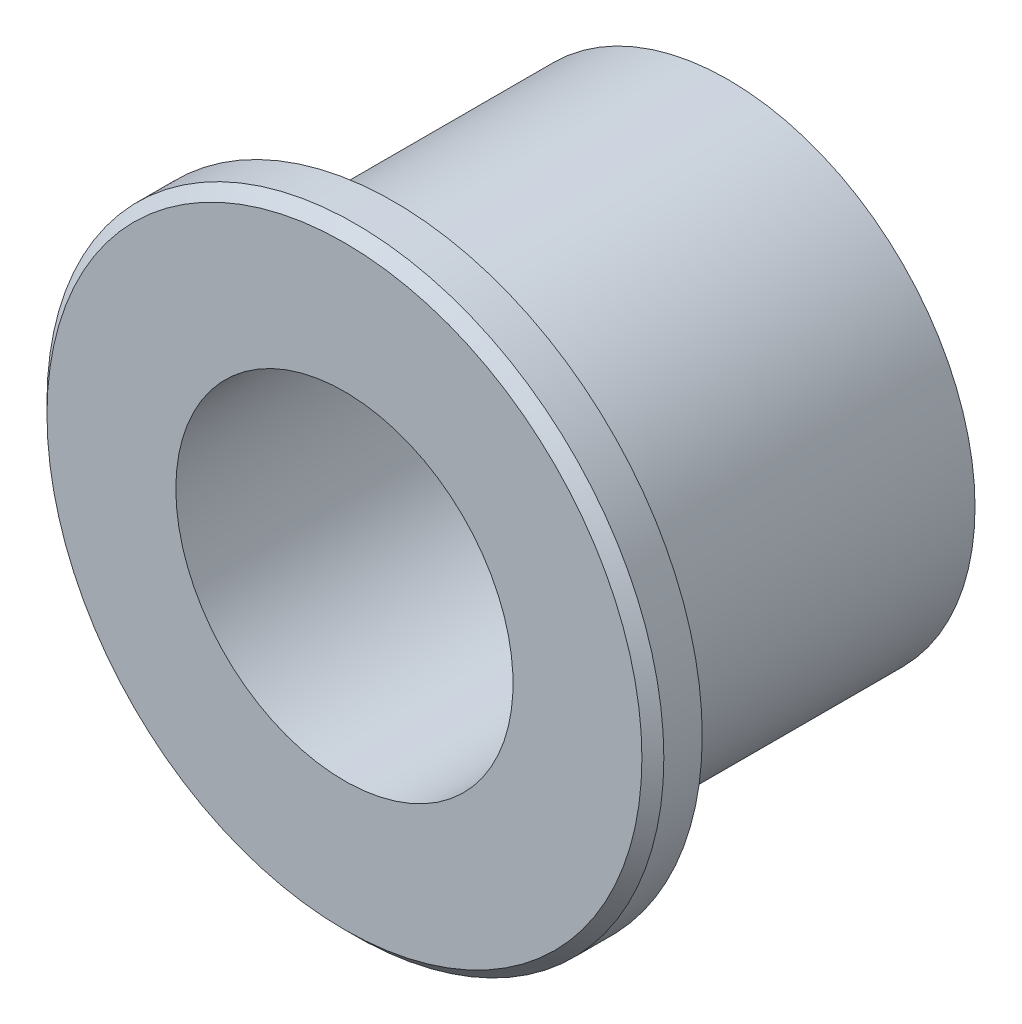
ISO-10303-21;
HEADER;
FILE_DESCRIPTION(('STEP AP214'),'2;1');
FILE_NAME('part.step','',(''),(''),'','','');
FILE_SCHEMA(('AUTOMOTIVE_DESIGN { 1 0 10303 214 1 1 1 1 }'));
ENDSEC;
DATA;
#1=APPLICATION_CONTEXT('core data for automotive mechanical design processes');
#2=APPLICATION_PROTOCOL_DEFINITION('international standard','automotive_design',2000,#1);
#3=PRODUCT_CONTEXT('',#1,'mechanical');
#4=PRODUCT('Part','Part','',(#3));
#5=PRODUCT_RELATED_PRODUCT_CATEGORY('part','',(#4));
#6=PRODUCT_DEFINITION_FORMATION('','',#4);
#7=PRODUCT_DEFINITION_CONTEXT('part definition',#1,'design');
#8=PRODUCT_DEFINITION('design','',#6,#7);
#9=PRODUCT_DEFINITION_SHAPE('','',#8);
#10=(LENGTH_UNIT() NAMED_UNIT(*) SI_UNIT(.MILLI.,.METRE.));
#11=(NAMED_UNIT(*) PLANE_ANGLE_UNIT() SI_UNIT($,.RADIAN.));
#12=(NAMED_UNIT(*) SI_UNIT($,.STERADIAN.) SOLID_ANGLE_UNIT());
#13=UNCERTAINTY_MEASURE_WITH_UNIT(LENGTH_MEASURE(1.E-05),#10,'distance_accuracy_value','');
#14=(GEOMETRIC_REPRESENTATION_CONTEXT(3) GLOBAL_UNCERTAINTY_ASSIGNED_CONTEXT((#13)) GLOBAL_UNIT_ASSIGNED_CONTEXT((#10,
#11,#12)) REPRESENTATION_CONTEXT('',''));
#15=CARTESIAN_POINT('',(0.,0.,0.));
#16=DIRECTION('',(0.,0.,1.));
#17=DIRECTION('',(1.,0.,0.));
#18=AXIS2_PLACEMENT_3D('',#15,#16,#17);
#19=CARTESIAN_POINT('',(0.,0.,0.));
#20=DIRECTION('',(0.,0.,-1.));
#21=DIRECTION('',(-1.,0.,0.));
#22=AXIS2_PLACEMENT_3D('',#19,#20,#21);
#23=PLANE('',#22);
#24=CARTESIAN_POINT('',(0.,0.,0.));
#25=DIRECTION('',(0.,0.,1.));
#26=DIRECTION('',(1.,0.,0.));
#27=AXIS2_PLACEMENT_3D('',#24,#25,#26);
#28=CIRCLE('',#27,9.4);
#29=CARTESIAN_POINT('',(9.4,0.,0.));
#30=VERTEX_POINT('',#29);
#31=EDGE_CURVE('E16',#30,#30,#28,.F.);
#32=ORIENTED_EDGE('',*,*,#31,.F.);
#33=EDGE_LOOP('',(#32));
#34=FACE_BOUND('',#33,.T.);
#35=CARTESIAN_POINT('',(0.,0.,0.));
#36=DIRECTION('',(0.,0.,1.));
#37=DIRECTION('',(1.,0.,0.));
#38=AXIS2_PLACEMENT_3D('',#35,#36,#37);
#39=CIRCLE('',#38,11.25);
#40=CARTESIAN_POINT('',(11.25,0.,0.));
#41=VERTEX_POINT('',#40);
#42=EDGE_CURVE('E36',#41,#41,#39,.T.);
#43=ORIENTED_EDGE('',*,*,#42,.F.);
#44=EDGE_LOOP('',(#43));
#45=FACE_BOUND('',#44,.T.);
#46=ADVANCED_FACE('F12',(#34,#45),#23,.T.);
#47=CARTESIAN_POINT('',(0.,0.,-0.4));
#48=DIRECTION('',(0.,0.,1.));
#49=DIRECTION('',(1.,0.,0.));
#50=AXIS2_PLACEMENT_3D('',#47,#48,#49);
#51=TOROIDAL_SURFACE('',#50,9.4,0.4);
#52=CARTESIAN_POINT('',(0.,0.,-0.4));
#53=DIRECTION('',(0.,0.,-1.));
#54=DIRECTION('',(1.,0.,0.));
#55=AXIS2_PLACEMENT_3D('',#52,#53,#54);
#56=CIRCLE('',#55,9.);
#57=CARTESIAN_POINT('',(9.,0.,-0.4));
#58=VERTEX_POINT('',#57);
#59=EDGE_CURVE('E28',#58,#58,#56,.T.);
#60=ORIENTED_EDGE('',*,*,#59,.F.);
#61=EDGE_LOOP('',(#60));
#62=FACE_BOUND('',#61,.T.);
#63=ORIENTED_EDGE('',*,*,#31,.T.);
#64=EDGE_LOOP('',(#63));
#65=FACE_BOUND('',#64,.T.);
#66=ADVANCED_FACE('F44',(#62,#65),#51,.F.);
#67=CARTESIAN_POINT('',(0.,0.,0.));
#68=DIRECTION('',(0.,0.,1.));
#69=DIRECTION('',(1.,0.,0.));
#70=AXIS2_PLACEMENT_3D('',#67,#68,#69);
#71=CYLINDRICAL_SURFACE('',#70,11.25);
#72=CARTESIAN_POINT('',(0.,0.,1.39999999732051));
#73=DIRECTION('',(0.,0.,-1.));
#74=DIRECTION('',(-1.,0.,0.));
#75=AXIS2_PLACEMENT_3D('',#72,#73,#74);
#76=CIRCLE('',#75,11.2499999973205);
#77=CARTESIAN_POINT('',(-11.2499999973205,0.,1.39999999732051));
#78=VERTEX_POINT('',#77);
#79=EDGE_CURVE('E35',#78,#78,#76,.F.);
#80=ORIENTED_EDGE('',*,*,#79,.F.);
#81=EDGE_LOOP('',(#80));
#82=FACE_BOUND('',#81,.T.);
#83=ORIENTED_EDGE('',*,*,#42,.T.);
#84=EDGE_LOOP('',(#83));
#85=FACE_BOUND('',#84,.T.);
#86=ADVANCED_FACE('F54',(#82,#85),#71,.T.);
#87=CARTESIAN_POINT('',(0.,0.,-0.4));
#88=DIRECTION('',(0.,0.,-1.));
#89=DIRECTION('',(-1.,0.,0.));
#90=AXIS2_PLACEMENT_3D('',#87,#88,#89);
#91=CYLINDRICAL_SURFACE('',#90,9.);
#92=CARTESIAN_POINT('',(0.,0.,-12.2));
#93=DIRECTION('',(0.,0.,-1.));
#94=DIRECTION('',(-1.,0.,0.));
#95=AXIS2_PLACEMENT_3D('',#92,#93,#94);
#96=CIRCLE('',#95,9.);
#97=CARTESIAN_POINT('',(-9.,0.,-12.2));
#98=VERTEX_POINT('',#97);
#99=EDGE_CURVE('E33',#98,#98,#96,.T.);
#100=ORIENTED_EDGE('',*,*,#99,.F.);
#101=EDGE_LOOP('',(#100));
#102=FACE_BOUND('',#101,.T.);
#103=ORIENTED_EDGE('',*,*,#59,.T.);
#104=EDGE_LOOP('',(#103));
#105=FACE_BOUND('',#104,.T.);
#106=ADVANCED_FACE('F75',(#102,#105),#91,.T.);
#107=CARTESIAN_POINT('',(0.,0.,1.80000000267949));
#108=DIRECTION('',(0.,0.,-1.));
#109=DIRECTION('',(-1.,0.,0.));
#110=AXIS2_PLACEMENT_3D('',#107,#108,#109);
#111=CONICAL_SURFACE('',#110,10.8500000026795,0.785398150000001);
#112=CARTESIAN_POINT('',(0.,0.,1.80000000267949));
#113=DIRECTION('',(0.,0.,-1.));
#114=DIRECTION('',(-1.,0.,0.));
#115=AXIS2_PLACEMENT_3D('',#112,#113,#114);
#116=CIRCLE('',#115,10.8500000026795);
#117=CARTESIAN_POINT('',(-10.8500000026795,0.,1.80000000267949));
#118=VERTEX_POINT('',#117);
#119=EDGE_CURVE('E25',#118,#118,#116,.F.);
#120=ORIENTED_EDGE('',*,*,#119,.F.);
#121=EDGE_LOOP('',(#120));
#122=FACE_BOUND('',#121,.T.);
#123=ORIENTED_EDGE('',*,*,#79,.T.);
#124=EDGE_LOOP('',(#123));
#125=FACE_BOUND('',#124,.T.);
#126=ADVANCED_FACE('F71',(#122,#125),#111,.T.);
#127=CARTESIAN_POINT('',(0.,0.,-12.2));
#128=DIRECTION('',(0.,0.,-1.));
#129=DIRECTION('',(-1.,0.,0.));
#130=AXIS2_PLACEMENT_3D('',#127,#128,#129);
#131=PLANE('',#130);
#132=CARTESIAN_POINT('',(0.,0.,-12.2));
#133=DIRECTION('',(0.,0.,-1.));
#134=DIRECTION('',(-1.,0.,0.));
#135=AXIS2_PLACEMENT_3D('',#132,#133,#134);
#136=CIRCLE('',#135,6.15);
#137=CARTESIAN_POINT('',(-6.15,0.,-12.2));
#138=VERTEX_POINT('',#137);
#139=EDGE_CURVE('E20',#138,#138,#136,.T.);
#140=ORIENTED_EDGE('',*,*,#139,.F.);
#141=EDGE_LOOP('',(#140));
#142=FACE_BOUND('',#141,.T.);
#143=ORIENTED_EDGE('',*,*,#99,.T.);
#144=EDGE_LOOP('',(#143));
#145=FACE_BOUND('',#144,.T.);
#146=ADVANCED_FACE('F64',(#142,#145),#131,.T.);
#147=CARTESIAN_POINT('',(0.,0.,1.8));
#148=DIRECTION('',(0.,0.,1.));
#149=DIRECTION('',(1.,0.,0.));
#150=AXIS2_PLACEMENT_3D('',#147,#148,#149);
#151=PLANE('',#150);
#152=CARTESIAN_POINT('',(0.,0.,1.8));
#153=DIRECTION('',(0.,0.,-1.));
#154=DIRECTION('',(-1.,0.,0.));
#155=AXIS2_PLACEMENT_3D('',#152,#153,#154);
#156=CIRCLE('',#155,6.15);
#157=CARTESIAN_POINT('',(-6.15,0.,1.8));
#158=VERTEX_POINT('',#157);
#159=EDGE_CURVE('E8',#158,#158,#156,.F.);
#160=ORIENTED_EDGE('',*,*,#159,.F.);
#161=EDGE_LOOP('',(#160));
#162=FACE_BOUND('',#161,.T.);
#163=ORIENTED_EDGE('',*,*,#119,.T.);
#164=EDGE_LOOP('',(#163));
#165=FACE_BOUND('',#164,.T.);
#166=ADVANCED_FACE('F58',(#162,#165),#151,.T.);
#167=CARTESIAN_POINT('',(0.,0.,1.8));
#168=DIRECTION('',(0.,0.,-1.));
#169=DIRECTION('',(-1.,0.,0.));
#170=AXIS2_PLACEMENT_3D('',#167,#168,#169);
#171=CYLINDRICAL_SURFACE('',#170,6.15);
#172=ORIENTED_EDGE('',*,*,#139,.T.);
#173=EDGE_LOOP('',(#172));
#174=FACE_BOUND('',#173,.T.);
#175=ORIENTED_EDGE('',*,*,#159,.T.);
#176=EDGE_LOOP('',(#175));
#177=FACE_BOUND('',#176,.T.);
#178=ADVANCED_FACE('F14',(#174,#177),#171,.F.);
#179=CLOSED_SHELL('',(#46,#66,#86,#106,#126,#146,#166,#178));
#180=MANIFOLD_SOLID_BREP('B1',#179);
#181=ADVANCED_BREP_SHAPE_REPRESENTATION('',(#18,#180),#14);
#182=SHAPE_DEFINITION_REPRESENTATION(#9,#181);
ENDSEC;
END-ISO-10303-21;
